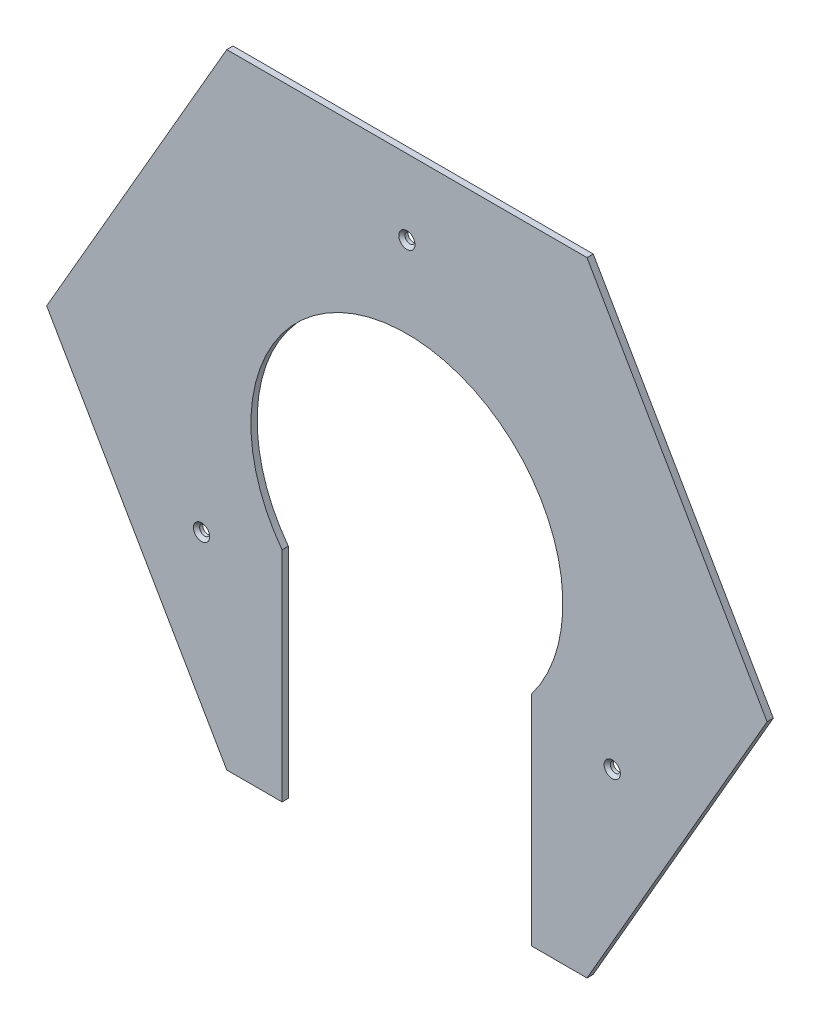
ISO-10303-21;
HEADER;
FILE_DESCRIPTION(('STEP AP214'),'2;1');
FILE_NAME('part.step','',(''),(''),'','','');
FILE_SCHEMA(('AUTOMOTIVE_DESIGN { 1 0 10303 214 1 1 1 1 }'));
ENDSEC;
DATA;
#1=APPLICATION_CONTEXT('core data for automotive mechanical design processes');
#2=APPLICATION_PROTOCOL_DEFINITION('international standard','automotive_design',2000,#1);
#3=PRODUCT_CONTEXT('',#1,'mechanical');
#4=PRODUCT('Part','Part','',(#3));
#5=PRODUCT_RELATED_PRODUCT_CATEGORY('part','',(#4));
#6=PRODUCT_DEFINITION_FORMATION('','',#4);
#7=PRODUCT_DEFINITION_CONTEXT('part definition',#1,'design');
#8=PRODUCT_DEFINITION('design','',#6,#7);
#9=PRODUCT_DEFINITION_SHAPE('','',#8);
#10=(LENGTH_UNIT() NAMED_UNIT(*) SI_UNIT(.MILLI.,.METRE.));
#11=(NAMED_UNIT(*) PLANE_ANGLE_UNIT() SI_UNIT($,.RADIAN.));
#12=(NAMED_UNIT(*) SI_UNIT($,.STERADIAN.) SOLID_ANGLE_UNIT());
#13=UNCERTAINTY_MEASURE_WITH_UNIT(LENGTH_MEASURE(1.E-05),#10,'distance_accuracy_value','');
#14=(GEOMETRIC_REPRESENTATION_CONTEXT(3) GLOBAL_UNCERTAINTY_ASSIGNED_CONTEXT((#13)) GLOBAL_UNIT_ASSIGNED_CONTEXT((#10,
#11,#12)) REPRESENTATION_CONTEXT('',''));
#15=CARTESIAN_POINT('',(0.,0.,0.));
#16=DIRECTION('',(0.,0.,1.));
#17=DIRECTION('',(1.,0.,0.));
#18=AXIS2_PLACEMENT_3D('',#15,#16,#17);
#19=CARTESIAN_POINT('',(57.735,-99.9999533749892,-2.));
#20=DIRECTION('',(0.866025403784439,-0.5,0.));
#21=DIRECTION('',(0.5,0.866025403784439,0.));
#22=AXIS2_PLACEMENT_3D('',#19,#20,#21);
#23=PLANE('',#22);
#24=DIRECTION('',(0.5,0.866025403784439,0.));
#25=VECTOR('',#24,1.);
#26=CARTESIAN_POINT('',(57.735,-99.9999533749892,0.));
#27=LINE('',#26,#25);
#28=CARTESIAN_POINT('',(57.735,-99.9999533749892,0.));
#29=VERTEX_POINT('',#28);
#30=CARTESIAN_POINT('',(115.47,0.,0.));
#31=VERTEX_POINT('',#30);
#32=EDGE_CURVE('E145',#29,#31,#27,.T.);
#33=ORIENTED_EDGE('',*,*,#32,.F.);
#34=DIRECTION('',(0.,0.,1.));
#35=VECTOR('',#34,1.);
#36=CARTESIAN_POINT('',(57.735,-99.9999533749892,-2.));
#37=LINE('',#36,#35);
#38=CARTESIAN_POINT('',(57.735,-99.9999533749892,-2.));
#39=VERTEX_POINT('',#38);
#40=EDGE_CURVE('E50',#39,#29,#37,.T.);
#41=ORIENTED_EDGE('',*,*,#40,.F.);
#42=DIRECTION('',(0.5,0.866025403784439,0.));
#43=VECTOR('',#42,1.);
#44=CARTESIAN_POINT('',(57.735,-99.9999533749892,-2.));
#45=LINE('',#44,#43);
#46=CARTESIAN_POINT('',(115.47,0.,-2.));
#47=VERTEX_POINT('',#46);
#48=EDGE_CURVE('E173',#39,#47,#45,.T.);
#49=ORIENTED_EDGE('',*,*,#48,.T.);
#50=DIRECTION('',(0.,0.,1.));
#51=VECTOR('',#50,1.);
#52=CARTESIAN_POINT('',(115.47,0.,-2.));
#53=LINE('',#52,#51);
#54=EDGE_CURVE('E97',#47,#31,#53,.T.);
#55=ORIENTED_EDGE('',*,*,#54,.T.);
#56=EDGE_LOOP('',(#33,#41,#49,#55));
#57=FACE_BOUND('',#56,.T.);
#58=ADVANCED_FACE('F33',(#57),#23,.T.);
#59=CARTESIAN_POINT('',(39.9999999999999,-99.9999533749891,-2.));
#60=DIRECTION('',(0.,-1.,0.));
#61=DIRECTION('',(1.,0.,0.));
#62=AXIS2_PLACEMENT_3D('',#59,#60,#61);
#63=PLANE('',#62);
#64=DIRECTION('',(1.,0.,0.));
#65=VECTOR('',#64,1.);
#66=CARTESIAN_POINT('',(39.9999999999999,-99.9999533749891,0.));
#67=LINE('',#66,#65);
#68=CARTESIAN_POINT('',(39.9999999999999,-99.9999533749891,0.));
#69=VERTEX_POINT('',#68);
#70=EDGE_CURVE('E170',#69,#29,#67,.T.);
#71=ORIENTED_EDGE('',*,*,#70,.F.);
#72=DIRECTION('',(0.,0.,1.));
#73=VECTOR('',#72,1.);
#74=CARTESIAN_POINT('',(39.9999999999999,-99.9999533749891,-2.));
#75=LINE('',#74,#73);
#76=CARTESIAN_POINT('',(39.9999999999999,-99.9999533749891,-2.));
#77=VERTEX_POINT('',#76);
#78=EDGE_CURVE('E85',#77,#69,#75,.T.);
#79=ORIENTED_EDGE('',*,*,#78,.F.);
#80=DIRECTION('',(1.,0.,0.));
#81=VECTOR('',#80,1.);
#82=CARTESIAN_POINT('',(39.9999999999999,-99.9999533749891,-2.));
#83=LINE('',#82,#81);
#84=EDGE_CURVE('E135',#77,#39,#83,.T.);
#85=ORIENTED_EDGE('',*,*,#84,.T.);
#86=ORIENTED_EDGE('',*,*,#40,.T.);
#87=EDGE_LOOP('',(#71,#79,#85,#86));
#88=FACE_BOUND('',#87,.T.);
#89=ADVANCED_FACE('F218',(#88),#63,.T.);
#90=CARTESIAN_POINT('',(39.9999999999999,-99.9999533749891,-2.));
#91=DIRECTION('',(-1.,0.,0.));
#92=DIRECTION('',(0.,-1.,0.));
#93=AXIS2_PLACEMENT_3D('',#90,#91,#92);
#94=PLANE('',#93);
#95=DIRECTION('',(0.,-1.,0.));
#96=VECTOR('',#95,1.);
#97=CARTESIAN_POINT('',(39.9999999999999,-99.9999533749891,0.));
#98=LINE('',#97,#96);
#99=CARTESIAN_POINT('',(40.,-30.,0.));
#100=VERTEX_POINT('',#99);
#101=EDGE_CURVE('E122',#100,#69,#98,.T.);
#102=ORIENTED_EDGE('',*,*,#101,.F.);
#103=DIRECTION('',(0.,0.,1.));
#104=VECTOR('',#103,1.);
#105=CARTESIAN_POINT('',(40.,-30.,-2.));
#106=LINE('',#105,#104);
#107=CARTESIAN_POINT('',(40.,-30.,-2.));
#108=VERTEX_POINT('',#107);
#109=EDGE_CURVE('E117',#108,#100,#106,.T.);
#110=ORIENTED_EDGE('',*,*,#109,.F.);
#111=DIRECTION('',(0.,-1.,0.));
#112=VECTOR('',#111,1.);
#113=CARTESIAN_POINT('',(39.9999999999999,-99.9999533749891,-2.));
#114=LINE('',#113,#112);
#115=EDGE_CURVE('E120',#108,#77,#114,.T.);
#116=ORIENTED_EDGE('',*,*,#115,.T.);
#117=ORIENTED_EDGE('',*,*,#78,.T.);
#118=EDGE_LOOP('',(#102,#110,#116,#117));
#119=FACE_BOUND('',#118,.T.);
#120=ADVANCED_FACE('F119',(#119),#94,.T.);
#121=CARTESIAN_POINT('',(0.,0.,-2.));
#122=DIRECTION('',(0.,0.,1.));
#123=DIRECTION('',(1.,0.,0.));
#124=AXIS2_PLACEMENT_3D('',#121,#122,#123);
#125=CYLINDRICAL_SURFACE('',#124,50.);
#126=CARTESIAN_POINT('',(0.,0.,0.));
#127=DIRECTION('',(0.,0.,-1.));
#128=DIRECTION('',(1.,0.,0.));
#129=AXIS2_PLACEMENT_3D('',#126,#127,#128);
#130=CIRCLE('',#129,50.);
#131=CARTESIAN_POINT('',(-40.,-30.,0.));
#132=VERTEX_POINT('',#131);
#133=EDGE_CURVE('E167',#132,#100,#130,.T.);
#134=ORIENTED_EDGE('',*,*,#133,.F.);
#135=DIRECTION('',(0.,0.,1.));
#136=VECTOR('',#135,1.);
#137=CARTESIAN_POINT('',(-40.,-30.,-2.));
#138=LINE('',#137,#136);
#139=CARTESIAN_POINT('',(-40.,-30.,-2.));
#140=VERTEX_POINT('',#139);
#141=EDGE_CURVE('E127',#140,#132,#138,.T.);
#142=ORIENTED_EDGE('',*,*,#141,.F.);
#143=CARTESIAN_POINT('',(0.,0.,-2.));
#144=DIRECTION('',(0.,0.,-1.));
#145=DIRECTION('',(1.,0.,0.));
#146=AXIS2_PLACEMENT_3D('',#143,#144,#145);
#147=CIRCLE('',#146,50.);
#148=EDGE_CURVE('E133',#140,#108,#147,.T.);
#149=ORIENTED_EDGE('',*,*,#148,.T.);
#150=ORIENTED_EDGE('',*,*,#109,.T.);
#151=EDGE_LOOP('',(#134,#142,#149,#150));
#152=FACE_BOUND('',#151,.T.);
#153=ADVANCED_FACE('F137',(#152),#125,.F.);
#154=CARTESIAN_POINT('',(-40.,-99.9999533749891,-2.));
#155=DIRECTION('',(1.,0.,0.));
#156=DIRECTION('',(0.,0.,-1.));
#157=AXIS2_PLACEMENT_3D('',#154,#155,#156);
#158=PLANE('',#157);
#159=DIRECTION('',(0.,1.,0.));
#160=VECTOR('',#159,1.);
#161=CARTESIAN_POINT('',(-40.,-99.9999533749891,0.));
#162=LINE('',#161,#160);
#163=CARTESIAN_POINT('',(-40.,-99.9999533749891,0.));
#164=VERTEX_POINT('',#163);
#165=EDGE_CURVE('E164',#164,#132,#162,.T.);
#166=ORIENTED_EDGE('',*,*,#165,.F.);
#167=DIRECTION('',(0.,0.,1.));
#168=VECTOR('',#167,1.);
#169=CARTESIAN_POINT('',(-40.,-99.9999533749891,-2.));
#170=LINE('',#169,#168);
#171=CARTESIAN_POINT('',(-40.,-99.9999533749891,-2.));
#172=VERTEX_POINT('',#171);
#173=EDGE_CURVE('E178',#172,#164,#170,.T.);
#174=ORIENTED_EDGE('',*,*,#173,.F.);
#175=DIRECTION('',(0.,1.,0.));
#176=VECTOR('',#175,1.);
#177=CARTESIAN_POINT('',(-40.,-99.9999533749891,-2.));
#178=LINE('',#177,#176);
#179=EDGE_CURVE('E138',#172,#140,#178,.T.);
#180=ORIENTED_EDGE('',*,*,#179,.T.);
#181=ORIENTED_EDGE('',*,*,#141,.T.);
#182=EDGE_LOOP('',(#166,#174,#180,#181));
#183=FACE_BOUND('',#182,.T.);
#184=ADVANCED_FACE('F243',(#183),#158,.T.);
#185=CARTESIAN_POINT('',(-57.735,-99.9999533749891,-2.));
#186=DIRECTION('',(0.,-1.,0.));
#187=DIRECTION('',(0.,0.,-1.));
#188=AXIS2_PLACEMENT_3D('',#185,#186,#187);
#189=PLANE('',#188);
#190=DIRECTION('',(1.,0.,0.));
#191=VECTOR('',#190,1.);
#192=CARTESIAN_POINT('',(-57.735,-99.9999533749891,0.));
#193=LINE('',#192,#191);
#194=CARTESIAN_POINT('',(-57.735,-99.9999533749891,0.));
#195=VERTEX_POINT('',#194);
#196=EDGE_CURVE('E161',#195,#164,#193,.T.);
#197=ORIENTED_EDGE('',*,*,#196,.F.);
#198=DIRECTION('',(0.,0.,1.));
#199=VECTOR('',#198,1.);
#200=CARTESIAN_POINT('',(-57.735,-99.9999533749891,-2.));
#201=LINE('',#200,#199);
#202=CARTESIAN_POINT('',(-57.735,-99.9999533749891,-2.));
#203=VERTEX_POINT('',#202);
#204=EDGE_CURVE('E180',#203,#195,#201,.T.);
#205=ORIENTED_EDGE('',*,*,#204,.F.);
#206=DIRECTION('',(1.,0.,0.));
#207=VECTOR('',#206,1.);
#208=CARTESIAN_POINT('',(-57.735,-99.9999533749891,-2.));
#209=LINE('',#208,#207);
#210=EDGE_CURVE('E140',#203,#172,#209,.T.);
#211=ORIENTED_EDGE('',*,*,#210,.T.);
#212=ORIENTED_EDGE('',*,*,#173,.T.);
#213=EDGE_LOOP('',(#197,#205,#211,#212));
#214=FACE_BOUND('',#213,.T.);
#215=ADVANCED_FACE('F239',(#214),#189,.T.);
#216=CARTESIAN_POINT('',(-115.47,0.,-2.));
#217=DIRECTION('',(-0.866025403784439,-0.5,0.));
#218=DIRECTION('',(0.5,-0.866025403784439,0.));
#219=AXIS2_PLACEMENT_3D('',#216,#217,#218);
#220=PLANE('',#219);
#221=DIRECTION('',(0.5,-0.866025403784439,0.));
#222=VECTOR('',#221,1.);
#223=CARTESIAN_POINT('',(-115.47,0.,0.));
#224=LINE('',#223,#222);
#225=CARTESIAN_POINT('',(-115.47,0.,0.));
#226=VERTEX_POINT('',#225);
#227=EDGE_CURVE('E158',#226,#195,#224,.T.);
#228=ORIENTED_EDGE('',*,*,#227,.F.);
#229=DIRECTION('',(0.,0.,1.));
#230=VECTOR('',#229,1.);
#231=CARTESIAN_POINT('',(-115.47,0.,-2.));
#232=LINE('',#231,#230);
#233=CARTESIAN_POINT('',(-115.47,0.,-2.));
#234=VERTEX_POINT('',#233);
#235=EDGE_CURVE('E182',#234,#226,#232,.T.);
#236=ORIENTED_EDGE('',*,*,#235,.F.);
#237=DIRECTION('',(0.5,-0.866025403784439,0.));
#238=VECTOR('',#237,1.);
#239=CARTESIAN_POINT('',(-115.47,0.,-2.));
#240=LINE('',#239,#238);
#241=EDGE_CURVE('E424',#234,#203,#240,.T.);
#242=ORIENTED_EDGE('',*,*,#241,.T.);
#243=ORIENTED_EDGE('',*,*,#204,.T.);
#244=EDGE_LOOP('',(#228,#236,#242,#243));
#245=FACE_BOUND('',#244,.T.);
#246=ADVANCED_FACE('F235',(#245),#220,.T.);
#247=CARTESIAN_POINT('',(-57.735,99.9999533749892,-2.));
#248=DIRECTION('',(-0.866025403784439,0.5,0.));
#249=DIRECTION('',(-0.5,-0.866025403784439,0.));
#250=AXIS2_PLACEMENT_3D('',#247,#248,#249);
#251=PLANE('',#250);
#252=DIRECTION('',(-0.5,-0.866025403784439,0.));
#253=VECTOR('',#252,1.);
#254=CARTESIAN_POINT('',(-57.735,99.9999533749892,0.));
#255=LINE('',#254,#253);
#256=CARTESIAN_POINT('',(-57.735,99.9999533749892,0.));
#257=VERTEX_POINT('',#256);
#258=EDGE_CURVE('E155',#257,#226,#255,.T.);
#259=ORIENTED_EDGE('',*,*,#258,.F.);
#260=DIRECTION('',(0.,0.,1.));
#261=VECTOR('',#260,1.);
#262=CARTESIAN_POINT('',(-57.735,99.9999533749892,-2.));
#263=LINE('',#262,#261);
#264=CARTESIAN_POINT('',(-57.735,99.9999533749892,-2.));
#265=VERTEX_POINT('',#264);
#266=EDGE_CURVE('E184',#265,#257,#263,.T.);
#267=ORIENTED_EDGE('',*,*,#266,.F.);
#268=DIRECTION('',(-0.5,-0.866025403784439,0.));
#269=VECTOR('',#268,1.);
#270=CARTESIAN_POINT('',(-57.735,99.9999533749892,-2.));
#271=LINE('',#270,#269);
#272=EDGE_CURVE('E421',#265,#234,#271,.T.);
#273=ORIENTED_EDGE('',*,*,#272,.T.);
#274=ORIENTED_EDGE('',*,*,#235,.T.);
#275=EDGE_LOOP('',(#259,#267,#273,#274));
#276=FACE_BOUND('',#275,.T.);
#277=ADVANCED_FACE('F231',(#276),#251,.T.);
#278=CARTESIAN_POINT('',(57.735,99.9999533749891,-2.));
#279=DIRECTION('',(0.,1.,0.));
#280=DIRECTION('',(-1.,0.,0.));
#281=AXIS2_PLACEMENT_3D('',#278,#279,#280);
#282=PLANE('',#281);
#283=DIRECTION('',(-1.,0.,0.));
#284=VECTOR('',#283,1.);
#285=CARTESIAN_POINT('',(57.735,99.9999533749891,0.));
#286=LINE('',#285,#284);
#287=CARTESIAN_POINT('',(57.735,99.9999533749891,0.));
#288=VERTEX_POINT('',#287);
#289=EDGE_CURVE('E152',#288,#257,#286,.T.);
#290=ORIENTED_EDGE('',*,*,#289,.F.);
#291=DIRECTION('',(0.,0.,1.));
#292=VECTOR('',#291,1.);
#293=CARTESIAN_POINT('',(57.735,99.9999533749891,-2.));
#294=LINE('',#293,#292);
#295=CARTESIAN_POINT('',(57.735,99.9999533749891,-2.));
#296=VERTEX_POINT('',#295);
#297=EDGE_CURVE('E186',#296,#288,#294,.T.);
#298=ORIENTED_EDGE('',*,*,#297,.F.);
#299=DIRECTION('',(-1.,0.,0.));
#300=VECTOR('',#299,1.);
#301=CARTESIAN_POINT('',(57.735,99.9999533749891,-2.));
#302=LINE('',#301,#300);
#303=EDGE_CURVE('E418',#296,#265,#302,.T.);
#304=ORIENTED_EDGE('',*,*,#303,.T.);
#305=ORIENTED_EDGE('',*,*,#266,.T.);
#306=EDGE_LOOP('',(#290,#298,#304,#305));
#307=FACE_BOUND('',#306,.T.);
#308=ADVANCED_FACE('F228',(#307),#282,.T.);
#309=CARTESIAN_POINT('',(115.47,0.,-2.));
#310=DIRECTION('',(0.866025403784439,0.5,0.));
#311=DIRECTION('',(-0.5,0.866025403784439,0.));
#312=AXIS2_PLACEMENT_3D('',#309,#310,#311);
#313=PLANE('',#312);
#314=DIRECTION('',(-0.5,0.866025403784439,0.));
#315=VECTOR('',#314,1.);
#316=CARTESIAN_POINT('',(115.47,0.,0.));
#317=LINE('',#316,#315);
#318=EDGE_CURVE('E148',#31,#288,#317,.T.);
#319=ORIENTED_EDGE('',*,*,#318,.F.);
#320=ORIENTED_EDGE('',*,*,#54,.F.);
#321=DIRECTION('',(-0.5,0.866025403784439,0.));
#322=VECTOR('',#321,1.);
#323=CARTESIAN_POINT('',(115.47,0.,-2.));
#324=LINE('',#323,#322);
#325=EDGE_CURVE('E416',#47,#296,#324,.T.);
#326=ORIENTED_EDGE('',*,*,#325,.T.);
#327=ORIENTED_EDGE('',*,*,#297,.T.);
#328=EDGE_LOOP('',(#319,#320,#326,#327));
#329=FACE_BOUND('',#328,.T.);
#330=ADVANCED_FACE('F225',(#329),#313,.T.);
#331=CARTESIAN_POINT('',(0.,0.,-2.));
#332=DIRECTION('',(0.,0.,1.));
#333=DIRECTION('',(1.,0.,0.));
#334=AXIS2_PLACEMENT_3D('',#331,#332,#333);
#335=PLANE('',#334);
#336=CARTESIAN_POINT('',(-65.8179306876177,-37.9999999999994,-2.));
#337=DIRECTION('',(0.,0.,1.));
#338=DIRECTION('',(1.,0.,0.));
#339=AXIS2_PLACEMENT_3D('',#336,#337,#338);
#340=CIRCLE('',#339,1.60000000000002);
#341=CARTESIAN_POINT('',(-64.2179306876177,-37.9999999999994,-2.));
#342=VERTEX_POINT('',#341);
#343=EDGE_CURVE('E408',#342,#342,#340,.T.);
#344=ORIENTED_EDGE('',*,*,#343,.T.);
#345=EDGE_LOOP('',(#344));
#346=FACE_BOUND('',#345,.T.);
#347=CARTESIAN_POINT('',(65.8179306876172,-38.0000000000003,-2.));
#348=DIRECTION('',(0.,0.,1.));
#349=DIRECTION('',(1.,0.,0.));
#350=AXIS2_PLACEMENT_3D('',#347,#348,#349);
#351=CIRCLE('',#350,1.6);
#352=CARTESIAN_POINT('',(67.4179306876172,-38.0000000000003,-2.));
#353=VERTEX_POINT('',#352);
#354=EDGE_CURVE('E406',#353,#353,#351,.T.);
#355=ORIENTED_EDGE('',*,*,#354,.T.);
#356=EDGE_LOOP('',(#355));
#357=FACE_BOUND('',#356,.T.);
#358=CARTESIAN_POINT('',(0.,76.,-2.));
#359=DIRECTION('',(0.,0.,1.));
#360=DIRECTION('',(1.,0.,0.));
#361=AXIS2_PLACEMENT_3D('',#358,#359,#360);
#362=CIRCLE('',#361,1.6);
#363=CARTESIAN_POINT('',(1.6,76.,-2.));
#364=VERTEX_POINT('',#363);
#365=EDGE_CURVE('E149',#364,#364,#362,.T.);
#366=ORIENTED_EDGE('',*,*,#365,.T.);
#367=EDGE_LOOP('',(#366));
#368=FACE_BOUND('',#367,.T.);
#369=ORIENTED_EDGE('',*,*,#48,.F.);
#370=ORIENTED_EDGE('',*,*,#84,.F.);
#371=ORIENTED_EDGE('',*,*,#115,.F.);
#372=ORIENTED_EDGE('',*,*,#148,.F.);
#373=ORIENTED_EDGE('',*,*,#179,.F.);
#374=ORIENTED_EDGE('',*,*,#210,.F.);
#375=ORIENTED_EDGE('',*,*,#241,.F.);
#376=ORIENTED_EDGE('',*,*,#272,.F.);
#377=ORIENTED_EDGE('',*,*,#303,.F.);
#378=ORIENTED_EDGE('',*,*,#325,.F.);
#379=EDGE_LOOP('',(#369,#370,#371,#372,#373,#374,#375,#376,#377,#378));
#380=FACE_BOUND('',#379,.T.);
#381=ADVANCED_FACE('F131',(#346,#357,#368,#380),#335,.F.);
#382=CARTESIAN_POINT('',(0.,0.,0.));
#383=DIRECTION('',(0.,0.,1.));
#384=DIRECTION('',(1.,0.,0.));
#385=AXIS2_PLACEMENT_3D('',#382,#383,#384);
#386=PLANE('',#385);
#387=CARTESIAN_POINT('',(65.8179306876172,-38.0000000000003,0.));
#388=DIRECTION('',(0.,0.,1.));
#389=DIRECTION('',(1.,0.,0.));
#390=AXIS2_PLACEMENT_3D('',#387,#388,#389);
#391=CIRCLE('',#390,2.59999999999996);
#392=CARTESIAN_POINT('',(68.4179306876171,-38.0000000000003,0.));
#393=VERTEX_POINT('',#392);
#394=EDGE_CURVE('E197',#393,#393,#391,.F.);
#395=ORIENTED_EDGE('',*,*,#394,.T.);
#396=EDGE_LOOP('',(#395));
#397=FACE_BOUND('',#396,.T.);
#398=CARTESIAN_POINT('',(-65.8179306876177,-37.9999999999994,0.));
#399=DIRECTION('',(0.,0.,1.));
#400=DIRECTION('',(1.,0.,0.));
#401=AXIS2_PLACEMENT_3D('',#398,#399,#400);
#402=CIRCLE('',#401,2.59999999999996);
#403=CARTESIAN_POINT('',(-63.2179306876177,-37.9999999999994,0.));
#404=VERTEX_POINT('',#403);
#405=EDGE_CURVE('E194',#404,#404,#402,.F.);
#406=ORIENTED_EDGE('',*,*,#405,.T.);
#407=EDGE_LOOP('',(#406));
#408=FACE_BOUND('',#407,.T.);
#409=CARTESIAN_POINT('',(0.,76.,0.));
#410=DIRECTION('',(0.,0.,1.));
#411=DIRECTION('',(1.,0.,0.));
#412=AXIS2_PLACEMENT_3D('',#409,#410,#411);
#413=CIRCLE('',#412,2.59999999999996);
#414=CARTESIAN_POINT('',(2.59999999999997,76.,0.));
#415=VERTEX_POINT('',#414);
#416=EDGE_CURVE('E191',#415,#415,#413,.F.);
#417=ORIENTED_EDGE('',*,*,#416,.T.);
#418=EDGE_LOOP('',(#417));
#419=FACE_BOUND('',#418,.T.);
#420=ORIENTED_EDGE('',*,*,#32,.T.);
#421=ORIENTED_EDGE('',*,*,#318,.T.);
#422=ORIENTED_EDGE('',*,*,#289,.T.);
#423=ORIENTED_EDGE('',*,*,#258,.T.);
#424=ORIENTED_EDGE('',*,*,#227,.T.);
#425=ORIENTED_EDGE('',*,*,#196,.T.);
#426=ORIENTED_EDGE('',*,*,#165,.T.);
#427=ORIENTED_EDGE('',*,*,#133,.T.);
#428=ORIENTED_EDGE('',*,*,#101,.T.);
#429=ORIENTED_EDGE('',*,*,#70,.T.);
#430=EDGE_LOOP('',(#420,#421,#422,#423,#424,#425,#426,#427,#428,#429));
#431=FACE_BOUND('',#430,.T.);
#432=ADVANCED_FACE('F252',(#397,#408,#419,#431),#386,.T.);
#433=CARTESIAN_POINT('',(0.,76.,-2.));
#434=DIRECTION('',(0.,0.,1.));
#435=DIRECTION('',(1.,0.,0.));
#436=AXIS2_PLACEMENT_3D('',#433,#434,#435);
#437=CYLINDRICAL_SURFACE('',#436,1.6);
#438=CARTESIAN_POINT('',(0.,76.,-0.999999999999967));
#439=DIRECTION('',(0.,0.,1.));
#440=DIRECTION('',(1.,0.,0.));
#441=AXIS2_PLACEMENT_3D('',#438,#439,#440);
#442=CIRCLE('',#441,1.6);
#443=CARTESIAN_POINT('',(1.6,76.,-0.999999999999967));
#444=VERTEX_POINT('',#443);
#445=EDGE_CURVE('E11',#444,#444,#442,.T.);
#446=ORIENTED_EDGE('',*,*,#445,.T.);
#447=EDGE_LOOP('',(#446));
#448=FACE_BOUND('',#447,.T.);
#449=ORIENTED_EDGE('',*,*,#365,.F.);
#450=EDGE_LOOP('',(#449));
#451=FACE_BOUND('',#450,.T.);
#452=ADVANCED_FACE('F255',(#448,#451),#437,.F.);
#453=CARTESIAN_POINT('',(65.8179306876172,-38.0000000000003,-2.));
#454=DIRECTION('',(0.,0.,1.));
#455=DIRECTION('',(1.,0.,0.));
#456=AXIS2_PLACEMENT_3D('',#453,#454,#455);
#457=CYLINDRICAL_SURFACE('',#456,1.6);
#458=CARTESIAN_POINT('',(65.8179306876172,-38.0000000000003,-0.999999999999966));
#459=DIRECTION('',(0.,0.,1.));
#460=DIRECTION('',(1.,0.,0.));
#461=AXIS2_PLACEMENT_3D('',#458,#459,#460);
#462=CIRCLE('',#461,1.6);
#463=CARTESIAN_POINT('',(67.4179306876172,-38.0000000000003,-0.999999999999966));
#464=VERTEX_POINT('',#463);
#465=EDGE_CURVE('E175',#464,#464,#462,.T.);
#466=ORIENTED_EDGE('',*,*,#465,.T.);
#467=EDGE_LOOP('',(#466));
#468=FACE_BOUND('',#467,.T.);
#469=ORIENTED_EDGE('',*,*,#354,.F.);
#470=EDGE_LOOP('',(#469));
#471=FACE_BOUND('',#470,.T.);
#472=ADVANCED_FACE('F262',(#468,#471),#457,.F.);
#473=CARTESIAN_POINT('',(-65.8179306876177,-37.9999999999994,-2.));
#474=DIRECTION('',(0.,0.,1.));
#475=DIRECTION('',(1.,0.,0.));
#476=AXIS2_PLACEMENT_3D('',#473,#474,#475);
#477=CYLINDRICAL_SURFACE('',#476,1.60000000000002);
#478=CARTESIAN_POINT('',(-65.8179306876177,-37.9999999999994,-0.999999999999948));
#479=DIRECTION('',(0.,0.,1.));
#480=DIRECTION('',(1.,0.,0.));
#481=AXIS2_PLACEMENT_3D('',#478,#479,#480);
#482=CIRCLE('',#481,1.60000000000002);
#483=CARTESIAN_POINT('',(-64.2179306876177,-37.9999999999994,-0.999999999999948));
#484=VERTEX_POINT('',#483);
#485=EDGE_CURVE('E42',#484,#484,#482,.T.);
#486=ORIENTED_EDGE('',*,*,#485,.T.);
#487=EDGE_LOOP('',(#486));
#488=FACE_BOUND('',#487,.T.);
#489=ORIENTED_EDGE('',*,*,#343,.F.);
#490=EDGE_LOOP('',(#489));
#491=FACE_BOUND('',#490,.T.);
#492=ADVANCED_FACE('F202',(#488,#491),#477,.F.);
#493=CARTESIAN_POINT('',(65.8179306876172,-38.0000000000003,-0.999999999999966));
#494=DIRECTION('',(0.,0.,1.));
#495=DIRECTION('',(1.,0.,0.));
#496=AXIS2_PLACEMENT_3D('',#493,#494,#495);
#497=CONICAL_SURFACE('',#496,1.6,0.785398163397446);
#498=ORIENTED_EDGE('',*,*,#394,.F.);
#499=EDGE_LOOP('',(#498));
#500=FACE_BOUND('',#499,.T.);
#501=ORIENTED_EDGE('',*,*,#465,.F.);
#502=EDGE_LOOP('',(#501));
#503=FACE_BOUND('',#502,.T.);
#504=ADVANCED_FACE('F207',(#500,#503),#497,.F.);
#505=CARTESIAN_POINT('',(-65.8179306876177,-37.9999999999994,-0.999999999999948));
#506=DIRECTION('',(0.,0.,1.));
#507=DIRECTION('',(1.,0.,0.));
#508=AXIS2_PLACEMENT_3D('',#505,#506,#507);
#509=CONICAL_SURFACE('',#508,1.60000000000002,0.785398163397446);
#510=ORIENTED_EDGE('',*,*,#405,.F.);
#511=EDGE_LOOP('',(#510));
#512=FACE_BOUND('',#511,.T.);
#513=ORIENTED_EDGE('',*,*,#485,.F.);
#514=EDGE_LOOP('',(#513));
#515=FACE_BOUND('',#514,.T.);
#516=ADVANCED_FACE('F205',(#512,#515),#509,.F.);
#517=CARTESIAN_POINT('',(0.,76.,-0.999999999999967));
#518=DIRECTION('',(0.,0.,1.));
#519=DIRECTION('',(1.,0.,0.));
#520=AXIS2_PLACEMENT_3D('',#517,#518,#519);
#521=CONICAL_SURFACE('',#520,1.6,0.785398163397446);
#522=ORIENTED_EDGE('',*,*,#416,.F.);
#523=EDGE_LOOP('',(#522));
#524=FACE_BOUND('',#523,.T.);
#525=ORIENTED_EDGE('',*,*,#445,.F.);
#526=EDGE_LOOP('',(#525));
#527=FACE_BOUND('',#526,.T.);
#528=ADVANCED_FACE('F35',(#524,#527),#521,.F.);
#529=CLOSED_SHELL('',(#58,#89,#120,#153,#184,#215,#246,#277,#308,#330,#381,#432,#452,#472,#492,
#504,#516,#528));
#530=MANIFOLD_SOLID_BREP('B2',#529);
#531=ADVANCED_BREP_SHAPE_REPRESENTATION('',(#18,#530),#14);
#532=SHAPE_DEFINITION_REPRESENTATION(#9,#531);
ENDSEC;
END-ISO-10303-21;
